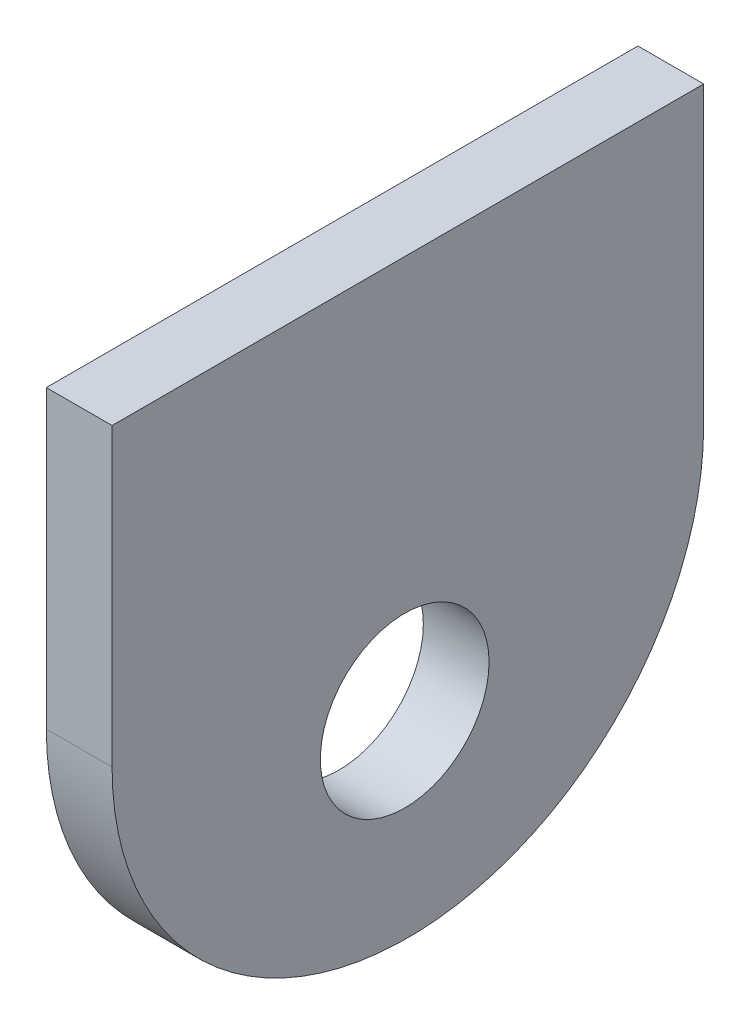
from build123d import *

# Parameters (mm, degrees)
SKETCH1_R           = 3.85
BOSS_EXTRUDE1_DEPTH = 3


with BuildPart() as part:
    # Sketch1 → Boss-Extrude1 (new body)
    with BuildSketch(Plane(origin=(0, 0, 0), x_dir=(0, 0, -1), z_dir=(1, 0, 0))):
        with BuildLine():
            Line((-13.5, 0), (-13.5, 13.5))
            Line((-13.5, 13.5), (13.5, 13.5))
            Line((13.5, 13.5), (13.5, 0))
            ThreePointArc((13.5, 0), (0, -13.5), (-13.5, 0))
        make_face()
        with Locations((-0.143951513, -4.448969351)):
            Circle(SKETCH1_R, mode=Mode.SUBTRACT)
    extrude(amount=BOSS_EXTRUDE1_DEPTH)


solid = part.part
